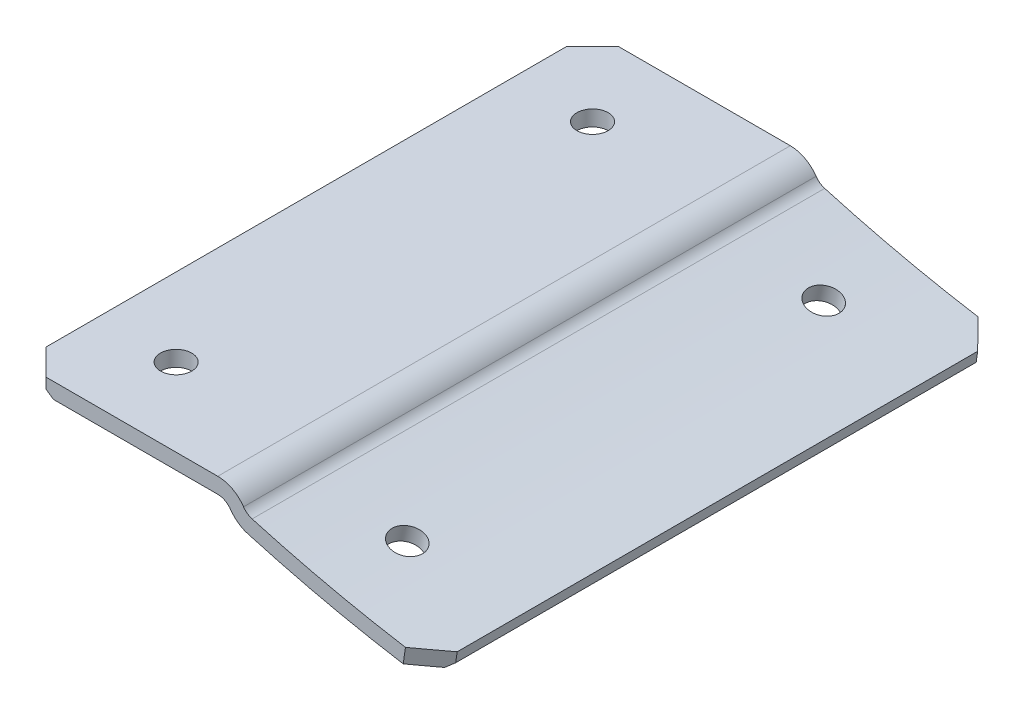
ISO-10303-21;
HEADER;
FILE_DESCRIPTION(('STEP AP214'),'2;1');
FILE_NAME('part.step','',(''),(''),'','','');
FILE_SCHEMA(('AUTOMOTIVE_DESIGN { 1 0 10303 214 1 1 1 1 }'));
ENDSEC;
DATA;
#1=APPLICATION_CONTEXT('core data for automotive mechanical design processes');
#2=APPLICATION_PROTOCOL_DEFINITION('international standard','automotive_design',2000,#1);
#3=PRODUCT_CONTEXT('',#1,'mechanical');
#4=PRODUCT('Part','Part','',(#3));
#5=PRODUCT_RELATED_PRODUCT_CATEGORY('part','',(#4));
#6=PRODUCT_DEFINITION_FORMATION('','',#4);
#7=PRODUCT_DEFINITION_CONTEXT('part definition',#1,'design');
#8=PRODUCT_DEFINITION('design','',#6,#7);
#9=PRODUCT_DEFINITION_SHAPE('','',#8);
#10=(LENGTH_UNIT() NAMED_UNIT(*) SI_UNIT(.MILLI.,.METRE.));
#11=(NAMED_UNIT(*) PLANE_ANGLE_UNIT() SI_UNIT($,.RADIAN.));
#12=(NAMED_UNIT(*) SI_UNIT($,.STERADIAN.) SOLID_ANGLE_UNIT());
#13=UNCERTAINTY_MEASURE_WITH_UNIT(LENGTH_MEASURE(1.E-05),#10,'distance_accuracy_value','');
#14=(GEOMETRIC_REPRESENTATION_CONTEXT(3) GLOBAL_UNCERTAINTY_ASSIGNED_CONTEXT((#13)) GLOBAL_UNIT_ASSIGNED_CONTEXT((#10,
#11,#12)) REPRESENTATION_CONTEXT('',''));
#15=CARTESIAN_POINT('',(0.,0.,0.));
#16=DIRECTION('',(0.,0.,1.));
#17=DIRECTION('',(1.,0.,0.));
#18=AXIS2_PLACEMENT_3D('',#15,#16,#17);
#19=CARTESIAN_POINT('',(101.733745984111,247.86768403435,55.));
#20=DIRECTION('',(0.,0.,-1.));
#21=DIRECTION('',(-1.,0.,0.));
#22=AXIS2_PLACEMENT_3D('',#19,#20,#21);
#23=CYLINDRICAL_SURFACE('',#22,264.801261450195);
#24=DIRECTION('',(0.,0.,-1.));
#25=VECTOR('',#24,1.);
#26=CARTESIAN_POINT('',(28.7734140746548,-6.68387858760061,55.));
#27=LINE('',#26,#25);
#28=CARTESIAN_POINT('',(28.7734140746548,-6.68387858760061,55.));
#29=VERTEX_POINT('',#28);
#30=CARTESIAN_POINT('',(28.7734140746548,-6.68387858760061,-55.));
#31=VERTEX_POINT('',#30);
#32=EDGE_CURVE('E468',#29,#31,#27,.T.);
#33=ORIENTED_EDGE('',*,*,#32,.T.);
#34=CARTESIAN_POINT('',(101.733745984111,247.86768403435,-55.));
#35=DIRECTION('',(0.,0.,1.));
#36=DIRECTION('',(1.,0.,0.));
#37=AXIS2_PLACEMENT_3D('',#34,#35,#36);
#38=CIRCLE('',#37,264.801261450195);
#39=CARTESIAN_POINT('',(58.6266176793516,-13.4013029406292,-55.));
#40=VERTEX_POINT('',#39);
#41=EDGE_CURVE('E197',#31,#40,#38,.T.);
#42=ORIENTED_EDGE('',*,*,#41,.T.);
#43=CARTESIAN_POINT('',(101.733745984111,247.86768403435,-49.9999999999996));
#44=DIRECTION('',(0.699723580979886,-0.10191619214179,-0.707106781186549));
#45=DIRECTION('',(0.69972358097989,-0.10191619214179,0.707106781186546));
#46=AXIS2_PLACEMENT_3D('',#43,#44,#45);
#47=ELLIPSE('',#46,374.485535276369,264.801261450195);
#48=CARTESIAN_POINT('',(62.5801802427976,-14.022954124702,-50.9981188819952));
#49=VERTEX_POINT('',#48);
#50=EDGE_CURVE('E489',#49,#40,#47,.T.);
#51=ORIENTED_EDGE('',*,*,#50,.F.);
#52=DIRECTION('',(0.,0.,-1.));
#53=VECTOR('',#52,1.);
#54=CARTESIAN_POINT('',(62.5801802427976,-14.0229541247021,55.));
#55=LINE('',#54,#53);
#56=CARTESIAN_POINT('',(62.5801802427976,-14.022954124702,50.9981188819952));
#57=VERTEX_POINT('',#56);
#58=EDGE_CURVE('E409',#49,#57,#55,.F.);
#59=ORIENTED_EDGE('',*,*,#58,.T.);
#60=CARTESIAN_POINT('',(101.733745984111,247.86768403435,49.9999999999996));
#61=DIRECTION('',(-0.699723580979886,0.10191619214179,-0.707106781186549));
#62=DIRECTION('',(0.69972358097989,-0.10191619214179,-0.707106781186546));
#63=AXIS2_PLACEMENT_3D('',#60,#61,#62);
#64=ELLIPSE('',#63,374.485535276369,264.801261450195);
#65=CARTESIAN_POINT('',(58.6266176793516,-13.4013029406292,55.));
#66=VERTEX_POINT('',#65);
#67=EDGE_CURVE('E381',#57,#66,#64,.T.);
#68=ORIENTED_EDGE('',*,*,#67,.T.);
#69=CARTESIAN_POINT('',(101.733745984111,247.86768403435,55.));
#70=DIRECTION('',(0.,0.,1.));
#71=DIRECTION('',(1.,0.,0.));
#72=AXIS2_PLACEMENT_3D('',#69,#70,#71);
#73=CIRCLE('',#72,264.801261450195);
#74=EDGE_CURVE('E477',#29,#66,#73,.T.);
#75=ORIENTED_EDGE('',*,*,#74,.F.);
#76=EDGE_LOOP('',(#33,#42,#51,#59,#68,#75));
#77=FACE_BOUND('',#76,.T.);
#78=CARTESIAN_POINT('',(46.6934717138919,-11.1502232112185,40.));
#79=CARTESIAN_POINT('',(46.6934643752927,-11.1502218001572,40.168508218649));
#80=CARTESIAN_POINT('',(46.6795368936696,-11.1472633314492,40.3371384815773));
#81=CARTESIAN_POINT('',(46.6241737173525,-11.1354894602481,40.6697545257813));
#82=CARTESIAN_POINT('',(46.5827049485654,-11.1266670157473,40.8337344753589));
#83=CARTESIAN_POINT('',(46.4734486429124,-11.1033774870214,41.1521830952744));
#84=CARTESIAN_POINT('',(46.4056737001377,-11.0889131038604,41.3066562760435));
#85=CARTESIAN_POINT('',(46.2457594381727,-11.0546944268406,41.6017326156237));
#86=CARTESIAN_POINT('',(46.1536261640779,-11.034941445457,41.7423392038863));
#87=CARTESIAN_POINT('',(45.9476055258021,-10.9906279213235,42.0057590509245));
#88=CARTESIAN_POINT('',(45.8337153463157,-10.9660667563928,42.1285700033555));
#89=CARTESIAN_POINT('',(45.5874338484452,-10.9127548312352,42.3528937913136));
#90=CARTESIAN_POINT('',(45.4550418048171,-10.8840039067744,42.4544057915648));
#91=CARTESIAN_POINT('',(45.1755369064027,-10.8230531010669,42.6332430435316));
#92=CARTESIAN_POINT('',(45.0284242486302,-10.7908532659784,42.7105686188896));
#93=CARTESIAN_POINT('',(44.7236674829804,-10.7238535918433,42.8388392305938));
#94=CARTESIAN_POINT('',(44.5660233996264,-10.6890537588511,42.8897843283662));
#95=CARTESIAN_POINT('',(44.2446960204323,-10.6177976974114,42.9638462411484));
#96=CARTESIAN_POINT('',(44.0810129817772,-10.5813415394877,42.9869642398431));
#97=CARTESIAN_POINT('',(43.7522532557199,-10.5077848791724,43.0047197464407));
#98=CARTESIAN_POINT('',(43.5871765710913,-10.4706843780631,42.9993573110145));
#99=CARTESIAN_POINT('',(43.2603181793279,-10.3968980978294,42.9603052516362));
#100=CARTESIAN_POINT('',(43.0985363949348,-10.3602123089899,42.9266162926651));
#101=CARTESIAN_POINT('',(42.7828486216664,-10.2883269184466,42.8318689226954));
#102=CARTESIAN_POINT('',(42.6289426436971,-10.2531273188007,42.7708104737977));
#103=CARTESIAN_POINT('',(42.3333554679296,-10.1852653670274,42.6230540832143));
#104=CARTESIAN_POINT('',(42.1916748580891,-10.1526031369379,42.5363549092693));
#105=CARTESIAN_POINT('',(41.9245519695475,-10.0908149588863,42.3397791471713));
#106=CARTESIAN_POINT('',(41.7991096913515,-10.0616890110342,42.229902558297));
#107=CARTESIAN_POINT('',(41.5679989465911,-10.0078771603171,41.9900829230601));
#108=CARTESIAN_POINT('',(41.462331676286,-9.98319152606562,41.8601386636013));
#109=CARTESIAN_POINT('',(41.2737625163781,-9.93904177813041,41.5838765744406));
#110=CARTESIAN_POINT('',(41.1908606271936,-9.91957766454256,41.4375587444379));
#111=CARTESIAN_POINT('',(41.0501622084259,-9.8864933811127,41.1327057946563));
#112=CARTESIAN_POINT('',(40.9923651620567,-9.87287309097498,40.9741709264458));
#113=CARTESIAN_POINT('',(40.9035038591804,-9.85191516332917,40.6493817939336));
#114=CARTESIAN_POINT('',(40.8724395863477,-9.84457752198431,40.4831275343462));
#115=CARTESIAN_POINT('',(40.8379211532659,-9.83642323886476,40.1476341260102));
#116=CARTESIAN_POINT('',(40.834464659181,-9.83560604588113,39.9783952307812));
#117=CARTESIAN_POINT('',(40.8552530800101,-9.84051776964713,39.6417234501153));
#118=CARTESIAN_POINT('',(40.8794979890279,-9.84624668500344,39.4742905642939));
#119=CARTESIAN_POINT('',(40.9550043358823,-9.86406433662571,39.1459898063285));
#120=CARTESIAN_POINT('',(41.0062648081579,-9.87615284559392,38.9851216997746));
#121=CARTESIAN_POINT('',(41.1343565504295,-9.90629907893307,38.6745098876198));
#122=CARTESIAN_POINT('',(41.2111878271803,-9.92435680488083,38.5247661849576));
#123=CARTESIAN_POINT('',(41.3882602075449,-9.9658643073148,38.2406437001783));
#124=CARTESIAN_POINT('',(41.4885027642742,-9.98931441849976,38.1062658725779));
#125=CARTESIAN_POINT('',(41.7095669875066,-10.0408634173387,37.8566991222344));
#126=CARTESIAN_POINT('',(41.8303886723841,-10.0689623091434,37.7415102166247));
#127=CARTESIAN_POINT('',(42.0892097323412,-10.1289341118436,37.5335824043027));
#128=CARTESIAN_POINT('',(42.2272103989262,-10.1608073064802,37.4408451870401));
#129=CARTESIAN_POINT('',(42.5164815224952,-10.2273481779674,37.2804645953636));
#130=CARTESIAN_POINT('',(42.6677519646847,-10.2620158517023,37.2128211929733));
#131=CARTESIAN_POINT('',(42.9792804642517,-10.3331028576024,37.1045493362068));
#132=CARTESIAN_POINT('',(43.1395384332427,-10.3695221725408,37.0639206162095));
#133=CARTESIAN_POINT('',(43.4645024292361,-10.44304176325,37.0108311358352));
#134=CARTESIAN_POINT('',(43.6292084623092,-10.4801420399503,36.9983704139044));
#135=CARTESIAN_POINT('',(43.958383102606,-10.5539558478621,37.0019712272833));
#136=CARTESIAN_POINT('',(44.1228517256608,-10.5906694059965,37.0180307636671));
#137=CARTESIAN_POINT('',(44.4468910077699,-10.6626853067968,37.0782126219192));
#138=CARTESIAN_POINT('',(44.6064616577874,-10.697987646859,37.1223349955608));
#139=CARTESIAN_POINT('',(44.9161644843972,-10.7662187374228,37.2373893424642));
#140=CARTESIAN_POINT('',(45.0662967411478,-10.799147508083,37.3083210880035));
#141=CARTESIAN_POINT('',(45.3528437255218,-10.8617566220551,37.4749776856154));
#142=CARTESIAN_POINT('',(45.4892589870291,-10.8914370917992,37.5707015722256));
#143=CARTESIAN_POINT('',(45.7444821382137,-10.9467813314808,37.7842182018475));
#144=CARTESIAN_POINT('',(45.8632911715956,-10.9724453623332,37.902009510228));
#145=CARTESIAN_POINT('',(46.0799511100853,-11.0191165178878,38.1563600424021));
#146=CARTESIAN_POINT('',(46.1777968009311,-11.0401224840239,38.2929239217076));
#147=CARTESIAN_POINT('',(46.3497395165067,-11.0769580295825,38.5809721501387));
#148=CARTESIAN_POINT('',(46.4238243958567,-11.0927849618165,38.7324640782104));
#149=CARTESIAN_POINT('',(46.5459919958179,-11.1188480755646,39.0458976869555));
#150=CARTESIAN_POINT('',(46.5941058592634,-11.1290909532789,39.2078265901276));
#151=CARTESIAN_POINT('',(46.6501433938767,-11.1410131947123,39.4756550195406));
#152=CARTESIAN_POINT('',(46.6663710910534,-11.1444631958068,39.5798146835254));
#153=CARTESIAN_POINT('',(46.6880375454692,-11.1490686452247,39.7893003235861));
#154=CARTESIAN_POINT('',(46.693476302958,-11.1502240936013,39.8946262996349));
#155=CARTESIAN_POINT('',(46.6934717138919,-11.1502232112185,40.));
#156=B_SPLINE_CURVE_WITH_KNOTS('',3,(#78,#79,#80,#81,#82,#83,#84,#85,#86,#87,#88,#89,#90,#91,
#92,#93,#94,#95,#96,#97,#98,#99,#100,#101,#102,#103,#104,#105,#106,#107,#108,#109,#110,#111,
#112,#113,#114,#115,#116,#117,#118,#119,#120,#121,#122,#123,#124,#125,#126,#127,#128,#129,#130,
#131,#132,#133,#134,#135,#136,#137,#138,#139,#140,#141,#142,#143,#144,#145,#146,#147,#148,#149,
#150,#151,#152,#153,#154,#155),.UNSPECIFIED.,.T.,.F.,(4,2,2,2,2,2,2,2,2,2,2,2,2,2,2,2,2,2,2,2,2,
2,2,2,2,2,2,2,2,2,2,2,2,2,2,2,2,2,4),(0.,0.505140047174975,1.01088781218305,1.5163937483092,
2.02177434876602,2.52722038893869,3.032686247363,3.53814534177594,4.04360325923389,
4.54903967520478,5.0544750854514,5.55989863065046,6.0653228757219,6.57077141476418,
7.07621996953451,7.58169909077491,8.08717822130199,8.59264694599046,9.09811536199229,
9.60354104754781,10.1089666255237,10.6143741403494,11.119781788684,11.6252208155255,
12.1306602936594,12.6361377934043,13.1416147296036,13.6470866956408,14.1525593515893,
14.6579965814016,15.1634347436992,15.6688686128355,16.1742828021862,16.6796641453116,
17.1851710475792,17.6909359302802,18.1960929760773,18.5119735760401,18.8278541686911),.UNSPECIFIED.);
#157=CARTESIAN_POINT('',(46.6934717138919,-11.1502232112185,40.));
#158=VERTEX_POINT('',#157);
#159=EDGE_CURVE('E301',#158,#158,#156,.T.);
#160=ORIENTED_EDGE('',*,*,#159,.F.);
#161=EDGE_LOOP('',(#160));
#162=FACE_BOUND('',#161,.T.);
#163=CARTESIAN_POINT('',(46.6934717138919,-11.1502232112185,-40.));
#164=CARTESIAN_POINT('',(46.6934643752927,-11.1502218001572,-40.168508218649));
#165=CARTESIAN_POINT('',(46.6795368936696,-11.1472633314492,-40.3371384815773));
#166=CARTESIAN_POINT('',(46.6241737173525,-11.1354894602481,-40.6697545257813));
#167=CARTESIAN_POINT('',(46.5827049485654,-11.1266670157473,-40.8337344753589));
#168=CARTESIAN_POINT('',(46.4734486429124,-11.1033774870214,-41.1521830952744));
#169=CARTESIAN_POINT('',(46.4056737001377,-11.0889131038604,-41.3066562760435));
#170=CARTESIAN_POINT('',(46.2457594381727,-11.0546944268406,-41.6017326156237));
#171=CARTESIAN_POINT('',(46.1536261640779,-11.034941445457,-41.7423392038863));
#172=CARTESIAN_POINT('',(45.9476055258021,-10.9906279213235,-42.0057590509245));
#173=CARTESIAN_POINT('',(45.8337153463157,-10.9660667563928,-42.1285700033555));
#174=CARTESIAN_POINT('',(45.5874338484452,-10.9127548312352,-42.3528937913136));
#175=CARTESIAN_POINT('',(45.4550418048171,-10.8840039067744,-42.4544057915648));
#176=CARTESIAN_POINT('',(45.1755369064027,-10.8230531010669,-42.6332430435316));
#177=CARTESIAN_POINT('',(45.0284242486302,-10.7908532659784,-42.7105686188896));
#178=CARTESIAN_POINT('',(44.7236674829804,-10.7238535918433,-42.8388392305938));
#179=CARTESIAN_POINT('',(44.5660233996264,-10.6890537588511,-42.8897843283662));
#180=CARTESIAN_POINT('',(44.2446960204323,-10.6177976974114,-42.9638462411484));
#181=CARTESIAN_POINT('',(44.0810129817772,-10.5813415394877,-42.9869642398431));
#182=CARTESIAN_POINT('',(43.7522532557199,-10.5077848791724,-43.0047197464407));
#183=CARTESIAN_POINT('',(43.5871765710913,-10.4706843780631,-42.9993573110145));
#184=CARTESIAN_POINT('',(43.2603181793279,-10.3968980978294,-42.9603052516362));
#185=CARTESIAN_POINT('',(43.0985363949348,-10.3602123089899,-42.9266162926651));
#186=CARTESIAN_POINT('',(42.7828486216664,-10.2883269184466,-42.8318689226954));
#187=CARTESIAN_POINT('',(42.6289426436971,-10.2531273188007,-42.7708104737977));
#188=CARTESIAN_POINT('',(42.3333554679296,-10.1852653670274,-42.6230540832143));
#189=CARTESIAN_POINT('',(42.1916748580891,-10.1526031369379,-42.5363549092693));
#190=CARTESIAN_POINT('',(41.9245519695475,-10.0908149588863,-42.3397791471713));
#191=CARTESIAN_POINT('',(41.7991096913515,-10.0616890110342,-42.229902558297));
#192=CARTESIAN_POINT('',(41.5679989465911,-10.0078771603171,-41.9900829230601));
#193=CARTESIAN_POINT('',(41.462331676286,-9.98319152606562,-41.8601386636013));
#194=CARTESIAN_POINT('',(41.2737625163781,-9.93904177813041,-41.5838765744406));
#195=CARTESIAN_POINT('',(41.1908606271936,-9.91957766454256,-41.4375587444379));
#196=CARTESIAN_POINT('',(41.0501622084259,-9.8864933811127,-41.1327057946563));
#197=CARTESIAN_POINT('',(40.9923651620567,-9.87287309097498,-40.9741709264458));
#198=CARTESIAN_POINT('',(40.9035038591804,-9.85191516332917,-40.6493817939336));
#199=CARTESIAN_POINT('',(40.8724395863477,-9.84457752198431,-40.4831275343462));
#200=CARTESIAN_POINT('',(40.8379211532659,-9.83642323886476,-40.1476341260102));
#201=CARTESIAN_POINT('',(40.834464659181,-9.83560604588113,-39.9783952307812));
#202=CARTESIAN_POINT('',(40.8552530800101,-9.84051776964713,-39.6417234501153));
#203=CARTESIAN_POINT('',(40.8794979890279,-9.84624668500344,-39.4742905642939));
#204=CARTESIAN_POINT('',(40.9550043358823,-9.86406433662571,-39.1459898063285));
#205=CARTESIAN_POINT('',(41.0062648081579,-9.87615284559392,-38.9851216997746));
#206=CARTESIAN_POINT('',(41.1343565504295,-9.90629907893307,-38.6745098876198));
#207=CARTESIAN_POINT('',(41.2111878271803,-9.92435680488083,-38.5247661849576));
#208=CARTESIAN_POINT('',(41.3882602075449,-9.9658643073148,-38.2406437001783));
#209=CARTESIAN_POINT('',(41.4885027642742,-9.98931441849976,-38.1062658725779));
#210=CARTESIAN_POINT('',(41.7095669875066,-10.0408634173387,-37.8566991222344));
#211=CARTESIAN_POINT('',(41.8303886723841,-10.0689623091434,-37.7415102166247));
#212=CARTESIAN_POINT('',(42.0892097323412,-10.1289341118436,-37.5335824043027));
#213=CARTESIAN_POINT('',(42.2272103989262,-10.1608073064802,-37.4408451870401));
#214=CARTESIAN_POINT('',(42.5164815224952,-10.2273481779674,-37.2804645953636));
#215=CARTESIAN_POINT('',(42.6677519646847,-10.2620158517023,-37.2128211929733));
#216=CARTESIAN_POINT('',(42.9792804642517,-10.3331028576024,-37.1045493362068));
#217=CARTESIAN_POINT('',(43.1395384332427,-10.3695221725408,-37.0639206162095));
#218=CARTESIAN_POINT('',(43.4645024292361,-10.44304176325,-37.0108311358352));
#219=CARTESIAN_POINT('',(43.6292084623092,-10.4801420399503,-36.9983704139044));
#220=CARTESIAN_POINT('',(43.958383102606,-10.5539558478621,-37.0019712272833));
#221=CARTESIAN_POINT('',(44.1228517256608,-10.5906694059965,-37.0180307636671));
#222=CARTESIAN_POINT('',(44.4468910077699,-10.6626853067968,-37.0782126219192));
#223=CARTESIAN_POINT('',(44.6064616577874,-10.697987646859,-37.1223349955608));
#224=CARTESIAN_POINT('',(44.9161644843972,-10.7662187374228,-37.2373893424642));
#225=CARTESIAN_POINT('',(45.0662967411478,-10.799147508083,-37.3083210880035));
#226=CARTESIAN_POINT('',(45.3528437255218,-10.8617566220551,-37.4749776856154));
#227=CARTESIAN_POINT('',(45.4892589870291,-10.8914370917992,-37.5707015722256));
#228=CARTESIAN_POINT('',(45.7444821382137,-10.9467813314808,-37.7842182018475));
#229=CARTESIAN_POINT('',(45.8632911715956,-10.9724453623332,-37.902009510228));
#230=CARTESIAN_POINT('',(46.0799511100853,-11.0191165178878,-38.1563600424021));
#231=CARTESIAN_POINT('',(46.1777968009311,-11.0401224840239,-38.2929239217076));
#232=CARTESIAN_POINT('',(46.3497395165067,-11.0769580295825,-38.5809721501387));
#233=CARTESIAN_POINT('',(46.4238243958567,-11.0927849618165,-38.7324640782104));
#234=CARTESIAN_POINT('',(46.5459919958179,-11.1188480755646,-39.0458976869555));
#235=CARTESIAN_POINT('',(46.5941058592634,-11.1290909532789,-39.2078265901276));
#236=CARTESIAN_POINT('',(46.6501433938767,-11.1410131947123,-39.4756550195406));
#237=CARTESIAN_POINT('',(46.6663710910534,-11.1444631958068,-39.5798146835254));
#238=CARTESIAN_POINT('',(46.6880375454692,-11.1490686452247,-39.7893003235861));
#239=CARTESIAN_POINT('',(46.693476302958,-11.1502240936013,-39.8946262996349));
#240=CARTESIAN_POINT('',(46.6934717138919,-11.1502232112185,-40.));
#241=B_SPLINE_CURVE_WITH_KNOTS('',3,(#163,#164,#165,#166,#167,#168,#169,#170,#171,#172,#173,
#174,#175,#176,#177,#178,#179,#180,#181,#182,#183,#184,#185,#186,#187,#188,#189,#190,#191,#192,
#193,#194,#195,#196,#197,#198,#199,#200,#201,#202,#203,#204,#205,#206,#207,#208,#209,#210,#211,
#212,#213,#214,#215,#216,#217,#218,#219,#220,#221,#222,#223,#224,#225,#226,#227,#228,#229,#230,
#231,#232,#233,#234,#235,#236,#237,#238,#239,#240),.UNSPECIFIED.,.T.,.F.,(4,2,2,2,2,2,2,2,2,2,2,
2,2,2,2,2,2,2,2,2,2,2,2,2,2,2,2,2,2,2,2,2,2,2,2,2,2,2,4),(0.,0.505140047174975,1.01088781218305,
1.5163937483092,2.02177434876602,2.52722038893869,3.032686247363,3.53814534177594,
4.04360325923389,4.54903967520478,5.0544750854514,5.55989863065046,6.0653228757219,
6.57077141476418,7.07621996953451,7.58169909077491,8.08717822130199,8.59264694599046,
9.09811536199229,9.60354104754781,10.1089666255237,10.6143741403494,11.119781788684,
11.6252208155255,12.1306602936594,12.6361377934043,13.1416147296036,13.6470866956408,
14.1525593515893,14.6579965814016,15.1634347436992,15.6688686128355,16.1742828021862,
16.6796641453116,17.1851710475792,17.6909359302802,18.1960929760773,18.5119735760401,
18.8278541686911),.UNSPECIFIED.);
#242=CARTESIAN_POINT('',(46.6934717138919,-11.1502232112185,-40.));
#243=VERTEX_POINT('',#242);
#244=EDGE_CURVE('E237',#243,#243,#241,.T.);
#245=ORIENTED_EDGE('',*,*,#244,.T.);
#246=EDGE_LOOP('',(#245));
#247=FACE_BOUND('',#246,.T.);
#248=ADVANCED_FACE('F46',(#77,#162,#247),#23,.T.);
#249=CARTESIAN_POINT('',(101.733745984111,247.86768403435,55.));
#250=DIRECTION('',(0.,0.,-1.));
#251=DIRECTION('',(-1.,0.,0.));
#252=AXIS2_PLACEMENT_3D('',#249,#250,#251);
#253=CYLINDRICAL_SURFACE('',#252,261.801261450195);
#254=CARTESIAN_POINT('',(101.733745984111,247.86768403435,55.));
#255=DIRECTION('',(0.,0.,1.));
#256=DIRECTION('',(1.,0.,0.));
#257=AXIS2_PLACEMENT_3D('',#254,#255,#256);
#258=CIRCLE('',#257,261.801261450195);
#259=CARTESIAN_POINT('',(29.6,-3.8,55.));
#260=VERTEX_POINT('',#259);
#261=CARTESIAN_POINT('',(59.0590894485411,-10.4320917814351,55.));
#262=VERTEX_POINT('',#261);
#263=EDGE_CURVE('E480',#260,#262,#258,.T.);
#264=ORIENTED_EDGE('',*,*,#263,.T.);
#265=CARTESIAN_POINT('',(101.733745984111,247.86768403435,49.9999999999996));
#266=DIRECTION('',(-0.699723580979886,0.10191619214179,-0.707106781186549));
#267=DIRECTION('',(0.69972358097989,-0.10191619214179,-0.707106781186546));
#268=AXIS2_PLACEMENT_3D('',#265,#266,#267);
#269=ELLIPSE('',#268,370.24289458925,261.801261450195);
#270=CARTESIAN_POINT('',(64.0000000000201,-11.2,50.));
#271=VERTEX_POINT('',#270);
#272=EDGE_CURVE('E398',#262,#271,#269,.F.);
#273=ORIENTED_EDGE('',*,*,#272,.T.);
#274=DIRECTION('',(0.,0.,-1.));
#275=VECTOR('',#274,1.);
#276=CARTESIAN_POINT('',(64.0000000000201,-11.2,55.));
#277=LINE('',#276,#275);
#278=CARTESIAN_POINT('',(64.0000000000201,-11.2,-50.));
#279=VERTEX_POINT('',#278);
#280=EDGE_CURVE('E178',#271,#279,#277,.T.);
#281=ORIENTED_EDGE('',*,*,#280,.T.);
#282=CARTESIAN_POINT('',(101.733745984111,247.86768403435,-49.9999999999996));
#283=DIRECTION('',(0.699723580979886,-0.10191619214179,-0.707106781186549));
#284=DIRECTION('',(0.69972358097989,-0.10191619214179,0.707106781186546));
#285=AXIS2_PLACEMENT_3D('',#282,#283,#284);
#286=ELLIPSE('',#285,370.24289458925,261.801261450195);
#287=CARTESIAN_POINT('',(59.0590894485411,-10.4320917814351,-55.));
#288=VERTEX_POINT('',#287);
#289=EDGE_CURVE('E195',#288,#279,#286,.F.);
#290=ORIENTED_EDGE('',*,*,#289,.F.);
#291=CARTESIAN_POINT('',(101.733745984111,247.86768403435,-55.));
#292=DIRECTION('',(0.,0.,1.));
#293=DIRECTION('',(1.,0.,0.));
#294=AXIS2_PLACEMENT_3D('',#291,#292,#293);
#295=CIRCLE('',#294,261.801261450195);
#296=CARTESIAN_POINT('',(29.6,-3.8,-55.));
#297=VERTEX_POINT('',#296);
#298=EDGE_CURVE('E185',#297,#288,#295,.T.);
#299=ORIENTED_EDGE('',*,*,#298,.F.);
#300=DIRECTION('',(0.,0.,-1.));
#301=VECTOR('',#300,1.);
#302=CARTESIAN_POINT('',(29.6,-3.8,55.));
#303=LINE('',#302,#301);
#304=EDGE_CURVE('E167',#260,#297,#303,.T.);
#305=ORIENTED_EDGE('',*,*,#304,.F.);
#306=EDGE_LOOP('',(#264,#273,#281,#290,#299,#305));
#307=FACE_BOUND('',#306,.T.);
#308=CARTESIAN_POINT('',(47.3428158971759,-8.22122088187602,40.));
#309=CARTESIAN_POINT('',(47.3428085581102,-8.22121947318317,40.1685081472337));
#310=CARTESIAN_POINT('',(47.3288807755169,-8.21826241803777,40.3371383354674));
#311=CARTESIAN_POINT('',(47.2735164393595,-8.20649401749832,40.6697542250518));
#312=CARTESIAN_POINT('',(47.2320468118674,-8.19767563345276,40.8337340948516));
#313=CARTESIAN_POINT('',(47.1227883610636,-8.17439630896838,41.1521825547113));
#314=CARTESIAN_POINT('',(47.0550121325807,-8.15993806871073,41.3066556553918));
#315=CARTESIAN_POINT('',(46.8950950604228,-8.12573290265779,41.6017318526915));
#316=CARTESIAN_POINT('',(46.802960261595,-8.1059872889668,41.742338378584));
#317=CARTESIAN_POINT('',(46.5969365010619,-8.06168865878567,42.0057582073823));
#318=CARTESIAN_POINT('',(46.4830447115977,-8.03713501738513,42.1285691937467));
#319=CARTESIAN_POINT('',(46.2367601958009,-7.98383717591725,42.3528930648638));
#320=CARTESIAN_POINT('',(46.1043667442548,-7.95509281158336,42.4544051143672));
#321=CARTESIAN_POINT('',(45.8248594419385,-7.89415309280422,42.6332424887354));
#322=CARTESIAN_POINT('',(45.6777457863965,-7.86195778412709,42.7105681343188));
#323=CARTESIAN_POINT('',(45.3729876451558,-7.7949642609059,42.8388388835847));
#324=CARTESIAN_POINT('',(45.2153431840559,-7.76016605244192,42.8897840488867));
#325=CARTESIAN_POINT('',(44.8940159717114,-7.68890980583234,42.9638460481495));
#326=CARTESIAN_POINT('',(44.730333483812,-7.65245184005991,42.9869640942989));
#327=CARTESIAN_POINT('',(44.4015756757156,-7.57888790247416,43.0047197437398));
#328=CARTESIAN_POINT('',(44.2365003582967,-7.54178193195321,42.9993574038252));
#329=CARTESIAN_POINT('',(43.9096455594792,-7.46798128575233,42.9603056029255));
#330=CARTESIAN_POINT('',(43.7478659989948,-7.43128660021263,42.9266168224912));
#331=CARTESIAN_POINT('',(43.4321832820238,-7.35938057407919,42.8318699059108));
#332=CARTESIAN_POINT('',(43.2782801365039,-7.32416923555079,42.7708117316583));
#333=CARTESIAN_POINT('',(42.9826988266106,-7.25628186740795,42.623055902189));
#334=CARTESIAN_POINT('',(42.841021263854,-7.22360596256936,42.536356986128));
#335=CARTESIAN_POINT('',(42.5739045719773,-7.16178972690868,42.3397817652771));
#336=CARTESIAN_POINT('',(42.4484654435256,-7.13264939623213,42.229905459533));
#337=CARTESIAN_POINT('',(42.2173606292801,-7.07880933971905,41.9900862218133));
#338=CARTESIAN_POINT('',(42.1116961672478,-7.05410988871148,41.8601420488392));
#339=CARTESIAN_POINT('',(41.9231321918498,-7.00993441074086,41.5838800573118));
#340=CARTESIAN_POINT('',(41.8402326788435,-6.99045838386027,41.4375622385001));
#341=CARTESIAN_POINT('',(41.6995383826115,-6.95735332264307,41.1327092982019));
#342=CARTESIAN_POINT('',(41.6417430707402,-6.94372416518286,40.9741744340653));
#343=CARTESIAN_POINT('',(41.5528843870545,-6.92275239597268,40.6493852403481));
#344=CARTESIAN_POINT('',(41.5218209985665,-6.91540978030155,40.4831309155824));
#345=CARTESIAN_POINT('',(41.4873034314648,-6.90724993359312,40.1476376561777));
#346=CARTESIAN_POINT('',(41.4838468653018,-6.90643213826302,39.978398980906));
#347=CARTESIAN_POINT('',(41.504634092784,-6.91134706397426,39.641727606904));
#348=CARTESIAN_POINT('',(41.5288778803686,-6.91707978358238,39.4742949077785));
#349=CARTESIAN_POINT('',(41.6043809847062,-6.93490906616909,39.1459946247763));
#350=CARTESIAN_POINT('',(41.6556393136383,-6.94700539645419,38.9851268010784));
#351=CARTESIAN_POINT('',(41.7837259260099,-6.9771705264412,38.6745154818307));
#352=CARTESIAN_POINT('',(41.8605542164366,-6.99523932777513,38.5247719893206));
#353=CARTESIAN_POINT('',(42.0376201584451,-7.03677119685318,38.2406496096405));
#354=CARTESIAN_POINT('',(42.1378592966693,-7.06023460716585,38.1062716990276));
#355=CARTESIAN_POINT('',(42.3589164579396,-7.1118111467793,37.8567046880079));
#356=CARTESIAN_POINT('',(42.4797344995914,-7.13992428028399,37.7415156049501));
#357=CARTESIAN_POINT('',(42.7385485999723,-7.19992425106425,37.5335871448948));
#358=CARTESIAN_POINT('',(42.8765459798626,-7.23181137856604,37.4408494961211));
#359=CARTESIAN_POINT('',(43.1658109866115,-7.29837852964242,37.2804680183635));
#360=CARTESIAN_POINT('',(43.3170785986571,-7.33305855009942,37.2128241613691));
#361=CARTESIAN_POINT('',(43.6286020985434,-7.40416763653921,37.1045514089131));
#362=CARTESIAN_POINT('',(43.7888578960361,-7.44059668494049,37.0639222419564));
#363=CARTESIAN_POINT('',(44.1138183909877,-7.51413243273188,37.0108318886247));
#364=CARTESIAN_POINT('',(44.2785230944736,-7.55123913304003,36.998370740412));
#365=CARTESIAN_POINT('',(44.6076957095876,-7.62506209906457,37.00197074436));
#366=CARTESIAN_POINT('',(44.7721636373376,-7.66177839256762,37.0180298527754));
#367=CARTESIAN_POINT('',(45.0962023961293,-7.73379622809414,37.0782108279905));
#368=CARTESIAN_POINT('',(45.2557732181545,-7.7690977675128,37.1223327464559));
#369=CARTESIAN_POINT('',(45.5654770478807,-7.83732418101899,37.2373861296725));
#370=CARTESIAN_POINT('',(45.7156101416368,-7.87024907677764,37.3083173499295));
#371=CARTESIAN_POINT('',(46.0021594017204,-7.93284819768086,37.4749728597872));
#372=CARTESIAN_POINT('',(46.1385761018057,-7.96252254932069,37.5706961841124));
#373=CARTESIAN_POINT('',(46.3938026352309,-8.01785336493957,37.7842117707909));
#374=CARTESIAN_POINT('',(46.5126135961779,-8.0435100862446,37.902002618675));
#375=CARTESIAN_POINT('',(46.7292775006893,-8.09016652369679,38.156352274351));
#376=CARTESIAN_POINT('',(46.8271252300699,-8.11116508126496,38.2929157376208));
#377=CARTESIAN_POINT('',(46.9990719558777,-8.14798680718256,38.5809633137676));
#378=CARTESIAN_POINT('',(47.0731587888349,-8.16380732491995,38.7324550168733));
#379=CARTESIAN_POINT('',(47.1953299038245,-8.18985951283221,39.0458882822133));
#380=CARTESIAN_POINT('',(47.2434453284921,-8.20009787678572,39.2078170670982));
#381=CARTESIAN_POINT('',(47.2994852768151,-8.21201490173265,39.4756469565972));
#382=CARTESIAN_POINT('',(47.3157138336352,-8.21546339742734,39.5798081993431));
#383=CARTESIAN_POINT('',(47.3373814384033,-8.22006682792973,39.7892970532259));
#384=CARTESIAN_POINT('',(47.3428204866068,-8.22122176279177,39.8946246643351));
#385=CARTESIAN_POINT('',(47.3428158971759,-8.22122088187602,40.));
#386=B_SPLINE_CURVE_WITH_KNOTS('',3,(#308,#309,#310,#311,#312,#313,#314,#315,#316,#317,#318,
#319,#320,#321,#322,#323,#324,#325,#326,#327,#328,#329,#330,#331,#332,#333,#334,#335,#336,#337,
#338,#339,#340,#341,#342,#343,#344,#345,#346,#347,#348,#349,#350,#351,#352,#353,#354,#355,#356,
#357,#358,#359,#360,#361,#362,#363,#364,#365,#366,#367,#368,#369,#370,#371,#372,#373,#374,#375,
#376,#377,#378,#379,#380,#381,#382,#383,#384,#385),.UNSPECIFIED.,.T.,.F.,(4,2,2,2,2,2,2,2,2,2,2,
2,2,2,2,2,2,2,2,2,2,2,2,2,2,2,2,2,2,2,2,2,2,2,2,2,2,2,4),(0.,0.505139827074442,1.01088735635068,
1.51639304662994,2.02177340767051,2.52721949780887,3.03268540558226,3.53814461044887,
4.04360263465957,4.5490386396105,5.05447363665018,5.55989649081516,6.06532004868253,
6.57076846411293,7.07621690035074,7.58169660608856,8.08717631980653,8.59264538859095,
9.09811414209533,9.60353918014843,10.1089641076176,10.6143705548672,11.1197771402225,
11.6252158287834,12.1306549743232,12.6361330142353,13.1416104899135,13.6470828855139,
14.1525559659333,14.6579928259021,15.1634306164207,15.6688637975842,16.1742773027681,
16.6796584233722,17.1851651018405,17.6909301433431,18.1960873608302,18.5119728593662,
18.827858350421),.UNSPECIFIED.);
#387=CARTESIAN_POINT('',(47.3428158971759,-8.22122088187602,40.));
#388=VERTEX_POINT('',#387);
#389=EDGE_CURVE('E311',#388,#388,#386,.T.);
#390=ORIENTED_EDGE('',*,*,#389,.T.);
#391=EDGE_LOOP('',(#390));
#392=FACE_BOUND('',#391,.T.);
#393=CARTESIAN_POINT('',(47.3428158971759,-8.22122088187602,-40.));
#394=CARTESIAN_POINT('',(47.3428085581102,-8.22121947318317,-40.1685081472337));
#395=CARTESIAN_POINT('',(47.3288807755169,-8.21826241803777,-40.3371383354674));
#396=CARTESIAN_POINT('',(47.2735164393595,-8.20649401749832,-40.6697542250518));
#397=CARTESIAN_POINT('',(47.2320468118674,-8.19767563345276,-40.8337340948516));
#398=CARTESIAN_POINT('',(47.1227883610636,-8.17439630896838,-41.1521825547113));
#399=CARTESIAN_POINT('',(47.0550121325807,-8.15993806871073,-41.3066556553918));
#400=CARTESIAN_POINT('',(46.8950950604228,-8.12573290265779,-41.6017318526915));
#401=CARTESIAN_POINT('',(46.802960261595,-8.1059872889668,-41.742338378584));
#402=CARTESIAN_POINT('',(46.5969365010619,-8.06168865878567,-42.0057582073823));
#403=CARTESIAN_POINT('',(46.4830447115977,-8.03713501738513,-42.1285691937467));
#404=CARTESIAN_POINT('',(46.2367601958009,-7.98383717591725,-42.3528930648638));
#405=CARTESIAN_POINT('',(46.1043667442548,-7.95509281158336,-42.4544051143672));
#406=CARTESIAN_POINT('',(45.8248594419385,-7.89415309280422,-42.6332424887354));
#407=CARTESIAN_POINT('',(45.6777457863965,-7.86195778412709,-42.7105681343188));
#408=CARTESIAN_POINT('',(45.3729876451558,-7.7949642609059,-42.8388388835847));
#409=CARTESIAN_POINT('',(45.2153431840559,-7.76016605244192,-42.8897840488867));
#410=CARTESIAN_POINT('',(44.8940159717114,-7.68890980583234,-42.9638460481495));
#411=CARTESIAN_POINT('',(44.730333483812,-7.65245184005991,-42.9869640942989));
#412=CARTESIAN_POINT('',(44.4015756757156,-7.57888790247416,-43.0047197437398));
#413=CARTESIAN_POINT('',(44.2365003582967,-7.54178193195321,-42.9993574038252));
#414=CARTESIAN_POINT('',(43.9096455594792,-7.46798128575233,-42.9603056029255));
#415=CARTESIAN_POINT('',(43.7478659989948,-7.43128660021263,-42.9266168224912));
#416=CARTESIAN_POINT('',(43.4321832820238,-7.35938057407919,-42.8318699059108));
#417=CARTESIAN_POINT('',(43.2782801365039,-7.32416923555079,-42.7708117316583));
#418=CARTESIAN_POINT('',(42.9826988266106,-7.25628186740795,-42.623055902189));
#419=CARTESIAN_POINT('',(42.841021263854,-7.22360596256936,-42.536356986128));
#420=CARTESIAN_POINT('',(42.5739045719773,-7.16178972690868,-42.3397817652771));
#421=CARTESIAN_POINT('',(42.4484654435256,-7.13264939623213,-42.229905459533));
#422=CARTESIAN_POINT('',(42.2173606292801,-7.07880933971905,-41.9900862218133));
#423=CARTESIAN_POINT('',(42.1116961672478,-7.05410988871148,-41.8601420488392));
#424=CARTESIAN_POINT('',(41.9231321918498,-7.00993441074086,-41.5838800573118));
#425=CARTESIAN_POINT('',(41.8402326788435,-6.99045838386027,-41.4375622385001));
#426=CARTESIAN_POINT('',(41.6995383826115,-6.95735332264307,-41.1327092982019));
#427=CARTESIAN_POINT('',(41.6417430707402,-6.94372416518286,-40.9741744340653));
#428=CARTESIAN_POINT('',(41.5528843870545,-6.92275239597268,-40.6493852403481));
#429=CARTESIAN_POINT('',(41.5218209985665,-6.91540978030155,-40.4831309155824));
#430=CARTESIAN_POINT('',(41.4873034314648,-6.90724993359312,-40.1476376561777));
#431=CARTESIAN_POINT('',(41.4838468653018,-6.90643213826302,-39.978398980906));
#432=CARTESIAN_POINT('',(41.504634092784,-6.91134706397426,-39.641727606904));
#433=CARTESIAN_POINT('',(41.5288778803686,-6.91707978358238,-39.4742949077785));
#434=CARTESIAN_POINT('',(41.6043809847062,-6.93490906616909,-39.1459946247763));
#435=CARTESIAN_POINT('',(41.6556393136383,-6.94700539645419,-38.9851268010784));
#436=CARTESIAN_POINT('',(41.7837259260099,-6.9771705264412,-38.6745154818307));
#437=CARTESIAN_POINT('',(41.8605542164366,-6.99523932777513,-38.5247719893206));
#438=CARTESIAN_POINT('',(42.0376201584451,-7.03677119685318,-38.2406496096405));
#439=CARTESIAN_POINT('',(42.1378592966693,-7.06023460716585,-38.1062716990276));
#440=CARTESIAN_POINT('',(42.3589164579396,-7.1118111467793,-37.8567046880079));
#441=CARTESIAN_POINT('',(42.4797344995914,-7.13992428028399,-37.7415156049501));
#442=CARTESIAN_POINT('',(42.7385485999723,-7.19992425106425,-37.5335871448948));
#443=CARTESIAN_POINT('',(42.8765459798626,-7.23181137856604,-37.4408494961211));
#444=CARTESIAN_POINT('',(43.1658109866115,-7.29837852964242,-37.2804680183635));
#445=CARTESIAN_POINT('',(43.3170785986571,-7.33305855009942,-37.2128241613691));
#446=CARTESIAN_POINT('',(43.6286020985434,-7.40416763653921,-37.1045514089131));
#447=CARTESIAN_POINT('',(43.7888578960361,-7.44059668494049,-37.0639222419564));
#448=CARTESIAN_POINT('',(44.1138183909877,-7.51413243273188,-37.0108318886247));
#449=CARTESIAN_POINT('',(44.2785230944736,-7.55123913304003,-36.998370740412));
#450=CARTESIAN_POINT('',(44.6076957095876,-7.62506209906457,-37.00197074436));
#451=CARTESIAN_POINT('',(44.7721636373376,-7.66177839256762,-37.0180298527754));
#452=CARTESIAN_POINT('',(45.0962023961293,-7.73379622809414,-37.0782108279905));
#453=CARTESIAN_POINT('',(45.2557732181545,-7.7690977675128,-37.1223327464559));
#454=CARTESIAN_POINT('',(45.5654770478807,-7.83732418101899,-37.2373861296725));
#455=CARTESIAN_POINT('',(45.7156101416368,-7.87024907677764,-37.3083173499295));
#456=CARTESIAN_POINT('',(46.0021594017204,-7.93284819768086,-37.4749728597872));
#457=CARTESIAN_POINT('',(46.1385761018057,-7.96252254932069,-37.5706961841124));
#458=CARTESIAN_POINT('',(46.3938026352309,-8.01785336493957,-37.7842117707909));
#459=CARTESIAN_POINT('',(46.5126135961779,-8.0435100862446,-37.902002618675));
#460=CARTESIAN_POINT('',(46.7292775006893,-8.09016652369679,-38.156352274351));
#461=CARTESIAN_POINT('',(46.8271252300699,-8.11116508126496,-38.2929157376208));
#462=CARTESIAN_POINT('',(46.9990719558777,-8.14798680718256,-38.5809633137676));
#463=CARTESIAN_POINT('',(47.0731587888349,-8.16380732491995,-38.7324550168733));
#464=CARTESIAN_POINT('',(47.1953299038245,-8.18985951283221,-39.0458882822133));
#465=CARTESIAN_POINT('',(47.2434453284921,-8.20009787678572,-39.2078170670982));
#466=CARTESIAN_POINT('',(47.2994852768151,-8.21201490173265,-39.4756469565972));
#467=CARTESIAN_POINT('',(47.3157138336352,-8.21546339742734,-39.5798081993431));
#468=CARTESIAN_POINT('',(47.3373814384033,-8.22006682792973,-39.7892970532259));
#469=CARTESIAN_POINT('',(47.3428204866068,-8.22122176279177,-39.8946246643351));
#470=CARTESIAN_POINT('',(47.3428158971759,-8.22122088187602,-40.));
#471=B_SPLINE_CURVE_WITH_KNOTS('',3,(#393,#394,#395,#396,#397,#398,#399,#400,#401,#402,#403,
#404,#405,#406,#407,#408,#409,#410,#411,#412,#413,#414,#415,#416,#417,#418,#419,#420,#421,#422,
#423,#424,#425,#426,#427,#428,#429,#430,#431,#432,#433,#434,#435,#436,#437,#438,#439,#440,#441,
#442,#443,#444,#445,#446,#447,#448,#449,#450,#451,#452,#453,#454,#455,#456,#457,#458,#459,#460,
#461,#462,#463,#464,#465,#466,#467,#468,#469,#470),.UNSPECIFIED.,.T.,.F.,(4,2,2,2,2,2,2,2,2,2,2,
2,2,2,2,2,2,2,2,2,2,2,2,2,2,2,2,2,2,2,2,2,2,2,2,2,2,2,4),(0.,0.505139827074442,1.01088735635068,
1.51639304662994,2.02177340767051,2.52721949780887,3.03268540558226,3.53814461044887,
4.04360263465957,4.5490386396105,5.05447363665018,5.55989649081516,6.06532004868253,
6.57076846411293,7.07621690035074,7.58169660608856,8.08717631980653,8.59264538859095,
9.09811414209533,9.60353918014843,10.1089641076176,10.6143705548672,11.1197771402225,
11.6252158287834,12.1306549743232,12.6361330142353,13.1416104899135,13.6470828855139,
14.1525559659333,14.6579928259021,15.1634306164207,15.6688637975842,16.1742773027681,
16.6796584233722,17.1851651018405,17.6909301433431,18.1960873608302,18.5119728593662,
18.827858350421),.UNSPECIFIED.);
#472=CARTESIAN_POINT('',(47.3428158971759,-8.22122088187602,-40.));
#473=VERTEX_POINT('',#472);
#474=EDGE_CURVE('E228',#473,#473,#471,.T.);
#475=ORIENTED_EDGE('',*,*,#474,.F.);
#476=EDGE_LOOP('',(#475));
#477=FACE_BOUND('',#476,.T.);
#478=ADVANCED_FACE('F192',(#307,#392,#477),#253,.F.);
#479=CARTESIAN_POINT('',(64.0000000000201,-11.2,55.));
#480=DIRECTION('',(0.989558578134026,-0.144131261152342,0.));
#481=DIRECTION('',(0.144131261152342,0.989558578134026,0.));
#482=AXIS2_PLACEMENT_3D('',#479,#480,#481);
#483=PLANE('',#482);
#484=DIRECTION('',(-0.144131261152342,-0.989558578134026,0.));
#485=VECTOR('',#484,1.);
#486=CARTESIAN_POINT('',(64.0000000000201,-11.2,50.));
#487=LINE('',#486,#485);
#488=CARTESIAN_POINT('',(63.7117374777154,-13.1791171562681,50.));
#489=VERTEX_POINT('',#488);
#490=EDGE_CURVE('E335',#271,#489,#487,.T.);
#491=ORIENTED_EDGE('',*,*,#490,.T.);
#492=DIRECTION('',(0.,0.,-1.));
#493=VECTOR('',#492,1.);
#494=CARTESIAN_POINT('',(63.7117374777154,-13.1791171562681,0.));
#495=LINE('',#494,#493);
#496=CARTESIAN_POINT('',(63.7117374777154,-13.1791171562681,-50.));
#497=VERTEX_POINT('',#496);
#498=EDGE_CURVE('E406',#489,#497,#495,.T.);
#499=ORIENTED_EDGE('',*,*,#498,.T.);
#500=DIRECTION('',(-0.144131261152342,-0.989558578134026,0.));
#501=VECTOR('',#500,1.);
#502=CARTESIAN_POINT('',(64.0000000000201,-11.2,-50.));
#503=LINE('',#502,#501);
#504=EDGE_CURVE('E223',#279,#497,#503,.T.);
#505=ORIENTED_EDGE('',*,*,#504,.F.);
#506=ORIENTED_EDGE('',*,*,#280,.F.);
#507=EDGE_LOOP('',(#491,#499,#505,#506));
#508=FACE_BOUND('',#507,.T.);
#509=ADVANCED_FACE('F291',(#508),#483,.T.);
#510=CARTESIAN_POINT('',(30.4265859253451,-0.91612141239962,55.));
#511=DIRECTION('',(0.,0.,-1.));
#512=DIRECTION('',(-1.,0.,0.));
#513=AXIS2_PLACEMENT_3D('',#510,#511,#512);
#514=CYLINDRICAL_SURFACE('',#513,2.99999999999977);
#515=ORIENTED_EDGE('',*,*,#304,.T.);
#516=CARTESIAN_POINT('',(30.4265859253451,-0.91612141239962,-55.));
#517=DIRECTION('',(0.,0.,1.));
#518=DIRECTION('',(-1.,0.,0.));
#519=AXIS2_PLACEMENT_3D('',#516,#517,#518);
#520=CIRCLE('',#519,2.99999999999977);
#521=CARTESIAN_POINT('',(27.9510572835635,-2.61074760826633,-55.));
#522=VERTEX_POINT('',#521);
#523=EDGE_CURVE('E170',#522,#297,#520,.T.);
#524=ORIENTED_EDGE('',*,*,#523,.F.);
#525=DIRECTION('',(0.,0.,-1.));
#526=VECTOR('',#525,1.);
#527=CARTESIAN_POINT('',(27.9510572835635,-2.61074760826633,55.));
#528=LINE('',#527,#526);
#529=CARTESIAN_POINT('',(27.9510572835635,-2.61074760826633,55.));
#530=VERTEX_POINT('',#529);
#531=EDGE_CURVE('E179',#530,#522,#528,.T.);
#532=ORIENTED_EDGE('',*,*,#531,.F.);
#533=CARTESIAN_POINT('',(30.4265859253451,-0.91612141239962,55.));
#534=DIRECTION('',(0.,0.,1.));
#535=DIRECTION('',(-1.,0.,0.));
#536=AXIS2_PLACEMENT_3D('',#533,#534,#535);
#537=CIRCLE('',#536,2.99999999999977);
#538=EDGE_CURVE('E172',#530,#260,#537,.T.);
#539=ORIENTED_EDGE('',*,*,#538,.T.);
#540=EDGE_LOOP('',(#515,#524,#532,#539));
#541=FACE_BOUND('',#540,.T.);
#542=ADVANCED_FACE('F169',(#541),#514,.F.);
#543=CARTESIAN_POINT('',(23.,-6.,55.));
#544=DIRECTION('',(0.,0.,-1.));
#545=DIRECTION('',(-1.,0.,0.));
#546=AXIS2_PLACEMENT_3D('',#543,#544,#545);
#547=CYLINDRICAL_SURFACE('',#546,6.);
#548=ORIENTED_EDGE('',*,*,#531,.T.);
#549=CARTESIAN_POINT('',(23.,-6.,-55.));
#550=DIRECTION('',(0.,0.,-1.));
#551=DIRECTION('',(-1.,0.,0.));
#552=AXIS2_PLACEMENT_3D('',#549,#550,#551);
#553=CIRCLE('',#552,6.);
#554=CARTESIAN_POINT('',(23.,0.,-55.));
#555=VERTEX_POINT('',#554);
#556=EDGE_CURVE('E188',#555,#522,#553,.T.);
#557=ORIENTED_EDGE('',*,*,#556,.F.);
#558=DIRECTION('',(0.,0.,-1.));
#559=VECTOR('',#558,1.);
#560=CARTESIAN_POINT('',(23.,0.,55.));
#561=LINE('',#560,#559);
#562=CARTESIAN_POINT('',(23.,0.,55.));
#563=VERTEX_POINT('',#562);
#564=EDGE_CURVE('E363',#563,#555,#561,.T.);
#565=ORIENTED_EDGE('',*,*,#564,.F.);
#566=CARTESIAN_POINT('',(23.,-6.,55.));
#567=DIRECTION('',(0.,0.,-1.));
#568=DIRECTION('',(-1.,0.,0.));
#569=AXIS2_PLACEMENT_3D('',#566,#567,#568);
#570=CIRCLE('',#569,6.);
#571=EDGE_CURVE('E778',#563,#530,#570,.T.);
#572=ORIENTED_EDGE('',*,*,#571,.T.);
#573=EDGE_LOOP('',(#548,#557,#565,#572));
#574=FACE_BOUND('',#573,.T.);
#575=ADVANCED_FACE('F341',(#574),#547,.T.);
#576=CARTESIAN_POINT('',(-15.,0.,55.));
#577=DIRECTION('',(0.,1.,0.));
#578=DIRECTION('',(0.,0.,1.));
#579=AXIS2_PLACEMENT_3D('',#576,#577,#578);
#580=PLANE('',#579);
#581=CARTESIAN_POINT('',(0.,0.,40.));
#582=DIRECTION('',(0.,1.,0.));
#583=DIRECTION('',(-1.,0.,0.));
#584=AXIS2_PLACEMENT_3D('',#581,#582,#583);
#585=CIRCLE('',#584,3.);
#586=CARTESIAN_POINT('',(-3.,0.,40.));
#587=VERTEX_POINT('',#586);
#588=EDGE_CURVE('E310',#587,#587,#585,.T.);
#589=ORIENTED_EDGE('',*,*,#588,.F.);
#590=EDGE_LOOP('',(#589));
#591=FACE_BOUND('',#590,.T.);
#592=DIRECTION('',(0.,0.,-1.));
#593=VECTOR('',#592,1.);
#594=CARTESIAN_POINT('',(-15.,0.,55.));
#595=LINE('',#594,#593);
#596=CARTESIAN_POINT('',(-15.,0.,50.));
#597=VERTEX_POINT('',#596);
#598=CARTESIAN_POINT('',(-15.,0.,-50.));
#599=VERTEX_POINT('',#598);
#600=EDGE_CURVE('E354',#597,#599,#595,.T.);
#601=ORIENTED_EDGE('',*,*,#600,.F.);
#602=DIRECTION('',(-0.707106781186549,0.,-0.707106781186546));
#603=VECTOR('',#602,1.);
#604=CARTESIAN_POINT('',(-12.5,0.,52.5));
#605=LINE('',#604,#603);
#606=CARTESIAN_POINT('',(-9.99999999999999,0.,55.));
#607=VERTEX_POINT('',#606);
#608=EDGE_CURVE('E356',#597,#607,#605,.F.);
#609=ORIENTED_EDGE('',*,*,#608,.T.);
#610=DIRECTION('',(1.,0.,0.));
#611=VECTOR('',#610,1.);
#612=CARTESIAN_POINT('',(-15.,0.,55.));
#613=LINE('',#612,#611);
#614=EDGE_CURVE('E437',#607,#563,#613,.T.);
#615=ORIENTED_EDGE('',*,*,#614,.T.);
#616=ORIENTED_EDGE('',*,*,#564,.T.);
#617=DIRECTION('',(1.,0.,0.));
#618=VECTOR('',#617,1.);
#619=CARTESIAN_POINT('',(-15.,0.,-55.));
#620=LINE('',#619,#618);
#621=CARTESIAN_POINT('',(-9.99999999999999,0.,-55.));
#622=VERTEX_POINT('',#621);
#623=EDGE_CURVE('E208',#622,#555,#620,.T.);
#624=ORIENTED_EDGE('',*,*,#623,.F.);
#625=DIRECTION('',(-0.707106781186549,0.,0.707106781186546));
#626=VECTOR('',#625,1.);
#627=CARTESIAN_POINT('',(-12.5,0.,-52.5));
#628=LINE('',#627,#626);
#629=EDGE_CURVE('E360',#599,#622,#628,.F.);
#630=ORIENTED_EDGE('',*,*,#629,.F.);
#631=EDGE_LOOP('',(#601,#609,#615,#616,#624,#630));
#632=FACE_BOUND('',#631,.T.);
#633=CARTESIAN_POINT('',(0.,0.,-40.));
#634=DIRECTION('',(0.,-1.,0.));
#635=DIRECTION('',(-1.,0.,0.));
#636=AXIS2_PLACEMENT_3D('',#633,#634,#635);
#637=CIRCLE('',#636,3.);
#638=CARTESIAN_POINT('',(-3.,0.,-40.));
#639=VERTEX_POINT('',#638);
#640=EDGE_CURVE('E227',#639,#639,#637,.T.);
#641=ORIENTED_EDGE('',*,*,#640,.T.);
#642=EDGE_LOOP('',(#641));
#643=FACE_BOUND('',#642,.T.);
#644=ADVANCED_FACE('F262',(#591,#632,#643),#580,.T.);
#645=CARTESIAN_POINT('',(-15.,-3.,55.));
#646=DIRECTION('',(-1.,0.,0.));
#647=DIRECTION('',(0.,0.,1.));
#648=AXIS2_PLACEMENT_3D('',#645,#646,#647);
#649=PLANE('',#648);
#650=ORIENTED_EDGE('',*,*,#600,.T.);
#651=DIRECTION('',(0.,1.,0.));
#652=VECTOR('',#651,1.);
#653=CARTESIAN_POINT('',(-15.,-3.,-50.));
#654=LINE('',#653,#652);
#655=CARTESIAN_POINT('',(-15.,-1.99999999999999,-50.));
#656=VERTEX_POINT('',#655);
#657=EDGE_CURVE('E493',#656,#599,#654,.T.);
#658=ORIENTED_EDGE('',*,*,#657,.F.);
#659=DIRECTION('',(0.,0.,1.));
#660=VECTOR('',#659,1.);
#661=CARTESIAN_POINT('',(-15.,-1.99999999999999,50.));
#662=LINE('',#661,#660);
#663=CARTESIAN_POINT('',(-15.,-1.99999999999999,50.));
#664=VERTEX_POINT('',#663);
#665=EDGE_CURVE('E11',#656,#664,#662,.T.);
#666=ORIENTED_EDGE('',*,*,#665,.T.);
#667=DIRECTION('',(0.,1.,0.));
#668=VECTOR('',#667,1.);
#669=CARTESIAN_POINT('',(-15.,-3.,50.));
#670=LINE('',#669,#668);
#671=EDGE_CURVE('E401',#664,#597,#670,.T.);
#672=ORIENTED_EDGE('',*,*,#671,.T.);
#673=EDGE_LOOP('',(#650,#658,#666,#672));
#674=FACE_BOUND('',#673,.T.);
#675=ADVANCED_FACE('F272',(#674),#649,.T.);
#676=CARTESIAN_POINT('',(-15.,-3.,55.));
#677=DIRECTION('',(0.,1.,0.));
#678=DIRECTION('',(0.,0.,1.));
#679=AXIS2_PLACEMENT_3D('',#676,#677,#678);
#680=PLANE('',#679);
#681=CARTESIAN_POINT('',(0.,-3.,40.));
#682=DIRECTION('',(0.,1.,0.));
#683=DIRECTION('',(0.,0.,1.));
#684=AXIS2_PLACEMENT_3D('',#681,#682,#683);
#685=CIRCLE('',#684,3.);
#686=CARTESIAN_POINT('',(0.,-3.,43.));
#687=VERTEX_POINT('',#686);
#688=EDGE_CURVE('E333',#687,#687,#685,.T.);
#689=ORIENTED_EDGE('',*,*,#688,.T.);
#690=EDGE_LOOP('',(#689));
#691=FACE_BOUND('',#690,.T.);
#692=DIRECTION('',(1.,0.,0.));
#693=VECTOR('',#692,1.);
#694=CARTESIAN_POINT('',(-15.,-3.,55.));
#695=LINE('',#694,#693);
#696=CARTESIAN_POINT('',(-8.58578643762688,-3.,55.));
#697=VERTEX_POINT('',#696);
#698=CARTESIAN_POINT('',(23.,-3.,55.));
#699=VERTEX_POINT('',#698);
#700=EDGE_CURVE('E430',#697,#699,#695,.T.);
#701=ORIENTED_EDGE('',*,*,#700,.F.);
#702=DIRECTION('',(-0.707106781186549,0.,-0.707106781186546));
#703=VECTOR('',#702,1.);
#704=CARTESIAN_POINT('',(-14.2928932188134,-3.,49.2928932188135));
#705=LINE('',#704,#703);
#706=CARTESIAN_POINT('',(-14.,-3.,49.5857864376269));
#707=VERTEX_POINT('',#706);
#708=EDGE_CURVE('E418',#697,#707,#705,.T.);
#709=ORIENTED_EDGE('',*,*,#708,.T.);
#710=DIRECTION('',(0.,0.,-1.));
#711=VECTOR('',#710,1.);
#712=CARTESIAN_POINT('',(-14.,-3.,0.));
#713=LINE('',#712,#711);
#714=CARTESIAN_POINT('',(-14.,-3.,-49.5857864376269));
#715=VERTEX_POINT('',#714);
#716=EDGE_CURVE('E415',#707,#715,#713,.T.);
#717=ORIENTED_EDGE('',*,*,#716,.T.);
#718=DIRECTION('',(-0.707106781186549,0.,0.707106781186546));
#719=VECTOR('',#718,1.);
#720=CARTESIAN_POINT('',(-14.2928932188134,-3.,-49.2928932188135));
#721=LINE('',#720,#719);
#722=CARTESIAN_POINT('',(-8.58578643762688,-3.,-55.));
#723=VERTEX_POINT('',#722);
#724=EDGE_CURVE('E449',#723,#715,#721,.T.);
#725=ORIENTED_EDGE('',*,*,#724,.F.);
#726=DIRECTION('',(1.,0.,0.));
#727=VECTOR('',#726,1.);
#728=CARTESIAN_POINT('',(-15.,-3.,-55.));
#729=LINE('',#728,#727);
#730=CARTESIAN_POINT('',(23.,-3.,-55.));
#731=VERTEX_POINT('',#730);
#732=EDGE_CURVE('E211',#723,#731,#729,.T.);
#733=ORIENTED_EDGE('',*,*,#732,.T.);
#734=DIRECTION('',(0.,0.,-1.));
#735=VECTOR('',#734,1.);
#736=CARTESIAN_POINT('',(23.,-3.,55.));
#737=LINE('',#736,#735);
#738=EDGE_CURVE('E364',#699,#731,#737,.T.);
#739=ORIENTED_EDGE('',*,*,#738,.F.);
#740=EDGE_LOOP('',(#701,#709,#717,#725,#733,#739));
#741=FACE_BOUND('',#740,.T.);
#742=CARTESIAN_POINT('',(0.,-3.,-40.));
#743=DIRECTION('',(0.,-1.,0.));
#744=DIRECTION('',(0.,0.,-1.));
#745=AXIS2_PLACEMENT_3D('',#742,#743,#744);
#746=CIRCLE('',#745,3.);
#747=CARTESIAN_POINT('',(0.,-3.,-43.));
#748=VERTEX_POINT('',#747);
#749=EDGE_CURVE('E202',#748,#748,#746,.T.);
#750=ORIENTED_EDGE('',*,*,#749,.F.);
#751=EDGE_LOOP('',(#750));
#752=FACE_BOUND('',#751,.T.);
#753=ADVANCED_FACE('F269',(#691,#741,#752),#680,.F.);
#754=CARTESIAN_POINT('',(23.,-6.,55.));
#755=DIRECTION('',(0.,0.,-1.));
#756=DIRECTION('',(-1.,0.,0.));
#757=AXIS2_PLACEMENT_3D('',#754,#755,#756);
#758=CYLINDRICAL_SURFACE('',#757,3.);
#759=ORIENTED_EDGE('',*,*,#738,.T.);
#760=CARTESIAN_POINT('',(23.,-6.,-55.));
#761=DIRECTION('',(0.,0.,1.));
#762=DIRECTION('',(1.,0.,0.));
#763=AXIS2_PLACEMENT_3D('',#760,#761,#762);
#764=CIRCLE('',#763,3.);
#765=CARTESIAN_POINT('',(25.4755286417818,-4.30537380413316,-55.));
#766=VERTEX_POINT('',#765);
#767=EDGE_CURVE('E215',#731,#766,#764,.F.);
#768=ORIENTED_EDGE('',*,*,#767,.T.);
#769=DIRECTION('',(0.,0.,-1.));
#770=VECTOR('',#769,1.);
#771=CARTESIAN_POINT('',(25.4755286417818,-4.30537380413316,55.));
#772=LINE('',#771,#770);
#773=CARTESIAN_POINT('',(25.4755286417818,-4.30537380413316,55.));
#774=VERTEX_POINT('',#773);
#775=EDGE_CURVE('E370',#774,#766,#772,.T.);
#776=ORIENTED_EDGE('',*,*,#775,.F.);
#777=CARTESIAN_POINT('',(23.,-6.,55.));
#778=DIRECTION('',(0.,0.,1.));
#779=DIRECTION('',(1.,0.,0.));
#780=AXIS2_PLACEMENT_3D('',#777,#778,#779);
#781=CIRCLE('',#780,3.);
#782=EDGE_CURVE('E436',#699,#774,#781,.F.);
#783=ORIENTED_EDGE('',*,*,#782,.F.);
#784=EDGE_LOOP('',(#759,#768,#776,#783));
#785=FACE_BOUND('',#784,.T.);
#786=ADVANCED_FACE('F271',(#785),#758,.F.);
#787=CARTESIAN_POINT('',(30.4265859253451,-0.91612141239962,55.));
#788=DIRECTION('',(0.,0.,-1.));
#789=DIRECTION('',(-1.,0.,0.));
#790=AXIS2_PLACEMENT_3D('',#787,#788,#789);
#791=CYLINDRICAL_SURFACE('',#790,5.99999999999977);
#792=ORIENTED_EDGE('',*,*,#775,.T.);
#793=CARTESIAN_POINT('',(30.4265859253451,-0.91612141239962,-55.));
#794=DIRECTION('',(0.,0.,1.));
#795=DIRECTION('',(1.,0.,0.));
#796=AXIS2_PLACEMENT_3D('',#793,#794,#795);
#797=CIRCLE('',#796,5.99999999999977);
#798=EDGE_CURVE('E219',#766,#31,#797,.T.);
#799=ORIENTED_EDGE('',*,*,#798,.T.);
#800=ORIENTED_EDGE('',*,*,#32,.F.);
#801=CARTESIAN_POINT('',(30.4265859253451,-0.91612141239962,55.));
#802=DIRECTION('',(0.,0.,1.));
#803=DIRECTION('',(1.,0.,0.));
#804=AXIS2_PLACEMENT_3D('',#801,#802,#803);
#805=CIRCLE('',#804,5.99999999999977);
#806=EDGE_CURVE('E464',#774,#29,#805,.T.);
#807=ORIENTED_EDGE('',*,*,#806,.F.);
#808=EDGE_LOOP('',(#792,#799,#800,#807));
#809=FACE_BOUND('',#808,.T.);
#810=ADVANCED_FACE('F279',(#809),#791,.T.);
#811=CARTESIAN_POINT('',(101.733745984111,247.86768403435,55.));
#812=DIRECTION('',(0.,0.,1.));
#813=DIRECTION('',(1.,0.,0.));
#814=AXIS2_PLACEMENT_3D('',#811,#812,#813);
#815=PLANE('',#814);
#816=DIRECTION('',(0.,-1.,0.));
#817=VECTOR('',#816,1.);
#818=CARTESIAN_POINT('',(-9.99999999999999,247.86768403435,55.));
#819=LINE('',#818,#817);
#820=CARTESIAN_POINT('',(-9.99999999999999,-1.99999999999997,55.));
#821=VERTEX_POINT('',#820);
#822=EDGE_CURVE('E387',#607,#821,#819,.T.);
#823=ORIENTED_EDGE('',*,*,#822,.T.);
#824=DIRECTION('',(-0.816496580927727,0.577350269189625,0.));
#825=VECTOR('',#824,1.);
#826=CARTESIAN_POINT('',(-53.2995918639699,28.6174350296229,55.));
#827=LINE('',#826,#825);
#828=EDGE_CURVE('E57',#821,#697,#827,.F.);
#829=ORIENTED_EDGE('',*,*,#828,.T.);
#830=ORIENTED_EDGE('',*,*,#700,.T.);
#831=ORIENTED_EDGE('',*,*,#782,.T.);
#832=ORIENTED_EDGE('',*,*,#806,.T.);
#833=ORIENTED_EDGE('',*,*,#74,.T.);
#834=DIRECTION('',(0.144131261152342,0.989558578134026,0.));
#835=VECTOR('',#834,1.);
#836=CARTESIAN_POINT('',(96.7859530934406,248.588340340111,55.));
#837=LINE('',#836,#835);
#838=EDGE_CURVE('E393',#66,#262,#837,.T.);
#839=ORIENTED_EDGE('',*,*,#838,.T.);
#840=ORIENTED_EDGE('',*,*,#263,.F.);
#841=ORIENTED_EDGE('',*,*,#538,.F.);
#842=ORIENTED_EDGE('',*,*,#571,.F.);
#843=ORIENTED_EDGE('',*,*,#614,.F.);
#844=EDGE_LOOP('',(#823,#829,#830,#831,#832,#833,#839,#840,#841,#842,#843));
#845=FACE_BOUND('',#844,.T.);
#846=ADVANCED_FACE('F429',(#845),#815,.T.);
#847=CARTESIAN_POINT('',(0.,-14.1686757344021,40.));
#848=DIRECTION('',(0.,1.,0.));
#849=DIRECTION('',(-1.,0.,0.));
#850=AXIS2_PLACEMENT_3D('',#847,#848,#849);
#851=CYLINDRICAL_SURFACE('',#850,3.);
#852=ORIENTED_EDGE('',*,*,#588,.T.);
#853=EDGE_LOOP('',(#852));
#854=FACE_BOUND('',#853,.T.);
#855=ORIENTED_EDGE('',*,*,#688,.F.);
#856=EDGE_LOOP('',(#855));
#857=FACE_BOUND('',#856,.T.);
#858=ADVANCED_FACE('F319',(#854,#857),#851,.F.);
#859=CARTESIAN_POINT('',(46.9314711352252,3.78400174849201,40.));
#860=DIRECTION('',(-0.216439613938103,-0.976296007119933,0.));
#861=DIRECTION('',(0.976296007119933,-0.216439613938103,0.));
#862=AXIS2_PLACEMENT_3D('',#859,#860,#861);
#863=CYLINDRICAL_SURFACE('',#862,3.);
#864=ORIENTED_EDGE('',*,*,#389,.F.);
#865=EDGE_LOOP('',(#864));
#866=FACE_BOUND('',#865,.T.);
#867=ORIENTED_EDGE('',*,*,#159,.T.);
#868=EDGE_LOOP('',(#867));
#869=FACE_BOUND('',#868,.T.);
#870=ADVANCED_FACE('F314',(#866,#869),#863,.F.);
#871=CARTESIAN_POINT('',(64.0000000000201,-11.2,50.));
#872=DIRECTION('',(-0.699723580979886,0.10191619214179,-0.707106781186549));
#873=DIRECTION('',(-0.144131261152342,-0.989558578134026,0.));
#874=AXIS2_PLACEMENT_3D('',#871,#872,#873);
#875=PLANE('',#874);
#876=ORIENTED_EDGE('',*,*,#67,.F.);
#877=DIRECTION('',(0.654536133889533,0.488107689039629,-0.577350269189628));
#878=VECTOR('',#877,1.);
#879=CARTESIAN_POINT('',(64.4675307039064,-12.615498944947,49.3333333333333));
#880=LINE('',#879,#878);
#881=EDGE_CURVE('E412',#57,#489,#880,.T.);
#882=ORIENTED_EDGE('',*,*,#881,.T.);
#883=ORIENTED_EDGE('',*,*,#490,.F.);
#884=ORIENTED_EDGE('',*,*,#272,.F.);
#885=ORIENTED_EDGE('',*,*,#838,.F.);
#886=EDGE_LOOP('',(#876,#882,#883,#884,#885));
#887=FACE_BOUND('',#886,.T.);
#888=ADVANCED_FACE('F298',(#887),#875,.F.);
#889=CARTESIAN_POINT('',(-15.,-3.,50.));
#890=DIRECTION('',(0.707106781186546,0.,-0.707106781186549));
#891=DIRECTION('',(0.,1.,0.));
#892=AXIS2_PLACEMENT_3D('',#889,#890,#891);
#893=PLANE('',#892);
#894=ORIENTED_EDGE('',*,*,#671,.F.);
#895=DIRECTION('',(-0.707106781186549,0.,-0.707106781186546));
#896=VECTOR('',#895,1.);
#897=CARTESIAN_POINT('',(-9.99999999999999,-1.99999999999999,55.));
#898=LINE('',#897,#896);
#899=EDGE_CURVE('E69',#664,#821,#898,.F.);
#900=ORIENTED_EDGE('',*,*,#899,.T.);
#901=ORIENTED_EDGE('',*,*,#822,.F.);
#902=ORIENTED_EDGE('',*,*,#608,.F.);
#903=EDGE_LOOP('',(#894,#900,#901,#902));
#904=FACE_BOUND('',#903,.T.);
#905=ADVANCED_FACE('F521',(#904),#893,.F.);
#906=CARTESIAN_POINT('',(63.7117374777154,-13.1791171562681,55.));
#907=DIRECTION('',(-0.597807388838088,0.801639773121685,0.));
#908=DIRECTION('',(0.,0.,-1.));
#909=AXIS2_PLACEMENT_3D('',#906,#907,#908);
#910=PLANE('',#909);
#911=ORIENTED_EDGE('',*,*,#881,.F.);
#912=ORIENTED_EDGE('',*,*,#58,.F.);
#913=DIRECTION('',(0.654536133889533,0.488107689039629,0.577350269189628));
#914=VECTOR('',#913,1.);
#915=CARTESIAN_POINT('',(64.4675307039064,-12.615498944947,-49.3333333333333));
#916=LINE('',#915,#914);
#917=EDGE_CURVE('E454',#49,#497,#916,.T.);
#918=ORIENTED_EDGE('',*,*,#917,.T.);
#919=ORIENTED_EDGE('',*,*,#498,.F.);
#920=EDGE_LOOP('',(#911,#912,#918,#919));
#921=FACE_BOUND('',#920,.T.);
#922=ADVANCED_FACE('F519',(#921),#910,.F.);
#923=CARTESIAN_POINT('',(-14.,-3.,55.));
#924=DIRECTION('',(-0.707106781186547,-0.707106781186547,0.));
#925=DIRECTION('',(0.,0.,1.));
#926=AXIS2_PLACEMENT_3D('',#923,#924,#925);
#927=PLANE('',#926);
#928=ORIENTED_EDGE('',*,*,#665,.F.);
#929=DIRECTION('',(0.678598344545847,-0.678598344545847,0.28108463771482));
#930=VECTOR('',#929,1.);
#931=CARTESIAN_POINT('',(-15.032726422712,-1.967273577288,-50.0135557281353));
#932=LINE('',#931,#930);
#933=EDGE_CURVE('E238',#656,#715,#932,.T.);
#934=ORIENTED_EDGE('',*,*,#933,.T.);
#935=ORIENTED_EDGE('',*,*,#716,.F.);
#936=DIRECTION('',(0.678598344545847,-0.678598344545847,-0.28108463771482));
#937=VECTOR('',#936,1.);
#938=CARTESIAN_POINT('',(-15.032726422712,-1.967273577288,50.0135557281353));
#939=LINE('',#938,#937);
#940=EDGE_CURVE('E51',#664,#707,#939,.T.);
#941=ORIENTED_EDGE('',*,*,#940,.F.);
#942=EDGE_LOOP('',(#928,#934,#935,#941));
#943=FACE_BOUND('',#942,.T.);
#944=ADVANCED_FACE('F49',(#943),#927,.T.);
#945=CARTESIAN_POINT('',(-11.7928932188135,-3.,51.7928932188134));
#946=DIRECTION('',(0.499999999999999,0.707106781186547,-0.500000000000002));
#947=DIRECTION('',(-0.707106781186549,0.,-0.707106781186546));
#948=AXIS2_PLACEMENT_3D('',#945,#946,#947);
#949=PLANE('',#948);
#950=ORIENTED_EDGE('',*,*,#828,.F.);
#951=ORIENTED_EDGE('',*,*,#899,.F.);
#952=ORIENTED_EDGE('',*,*,#940,.T.);
#953=ORIENTED_EDGE('',*,*,#708,.F.);
#954=EDGE_LOOP('',(#950,#951,#952,#953));
#955=FACE_BOUND('',#954,.T.);
#956=ADVANCED_FACE('F439',(#955),#949,.F.);
#957=CARTESIAN_POINT('',(101.733745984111,247.86768403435,-55.));
#958=DIRECTION('',(0.,0.,-1.));
#959=DIRECTION('',(1.,0.,0.));
#960=AXIS2_PLACEMENT_3D('',#957,#958,#959);
#961=PLANE('',#960);
#962=DIRECTION('',(0.,-1.,0.));
#963=VECTOR('',#962,1.);
#964=CARTESIAN_POINT('',(-9.99999999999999,247.86768403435,-55.));
#965=LINE('',#964,#963);
#966=CARTESIAN_POINT('',(-9.99999999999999,-1.99999999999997,-55.));
#967=VERTEX_POINT('',#966);
#968=EDGE_CURVE('E499',#622,#967,#965,.T.);
#969=ORIENTED_EDGE('',*,*,#968,.F.);
#970=ORIENTED_EDGE('',*,*,#623,.T.);
#971=ORIENTED_EDGE('',*,*,#556,.T.);
#972=ORIENTED_EDGE('',*,*,#523,.T.);
#973=ORIENTED_EDGE('',*,*,#298,.T.);
#974=DIRECTION('',(0.144131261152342,0.989558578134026,0.));
#975=VECTOR('',#974,1.);
#976=CARTESIAN_POINT('',(96.7859530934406,248.588340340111,-55.));
#977=LINE('',#976,#975);
#978=EDGE_CURVE('E491',#40,#288,#977,.T.);
#979=ORIENTED_EDGE('',*,*,#978,.F.);
#980=ORIENTED_EDGE('',*,*,#41,.F.);
#981=ORIENTED_EDGE('',*,*,#798,.F.);
#982=ORIENTED_EDGE('',*,*,#767,.F.);
#983=ORIENTED_EDGE('',*,*,#732,.F.);
#984=DIRECTION('',(-0.816496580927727,0.577350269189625,0.));
#985=VECTOR('',#984,1.);
#986=CARTESIAN_POINT('',(-53.2995918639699,28.6174350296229,-55.));
#987=LINE('',#986,#985);
#988=EDGE_CURVE('E444',#967,#723,#987,.F.);
#989=ORIENTED_EDGE('',*,*,#988,.F.);
#990=EDGE_LOOP('',(#969,#970,#971,#972,#973,#979,#980,#981,#982,#983,#989));
#991=FACE_BOUND('',#990,.T.);
#992=ADVANCED_FACE('F184',(#991),#961,.T.);
#993=CARTESIAN_POINT('',(0.,-14.1686757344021,-40.));
#994=DIRECTION('',(0.,1.,0.));
#995=DIRECTION('',(-1.,0.,0.));
#996=AXIS2_PLACEMENT_3D('',#993,#994,#995);
#997=CYLINDRICAL_SURFACE('',#996,3.);
#998=ORIENTED_EDGE('',*,*,#640,.F.);
#999=EDGE_LOOP('',(#998));
#1000=FACE_BOUND('',#999,.T.);
#1001=ORIENTED_EDGE('',*,*,#749,.T.);
#1002=EDGE_LOOP('',(#1001));
#1003=FACE_BOUND('',#1002,.T.);
#1004=ADVANCED_FACE('F264',(#1000,#1003),#997,.F.);
#1005=CARTESIAN_POINT('',(46.9314711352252,3.78400174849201,-40.));
#1006=DIRECTION('',(-0.216439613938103,-0.976296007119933,0.));
#1007=DIRECTION('',(0.976296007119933,-0.216439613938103,0.));
#1008=AXIS2_PLACEMENT_3D('',#1005,#1006,#1007);
#1009=CYLINDRICAL_SURFACE('',#1008,3.);
#1010=ORIENTED_EDGE('',*,*,#474,.T.);
#1011=EDGE_LOOP('',(#1010));
#1012=FACE_BOUND('',#1011,.T.);
#1013=ORIENTED_EDGE('',*,*,#244,.F.);
#1014=EDGE_LOOP('',(#1013));
#1015=FACE_BOUND('',#1014,.T.);
#1016=ADVANCED_FACE('F240',(#1012,#1015),#1009,.F.);
#1017=CARTESIAN_POINT('',(64.0000000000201,-11.2,-50.));
#1018=DIRECTION('',(-0.699723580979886,0.10191619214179,0.707106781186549));
#1019=DIRECTION('',(-0.144131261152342,-0.989558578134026,0.));
#1020=AXIS2_PLACEMENT_3D('',#1017,#1018,#1019);
#1021=PLANE('',#1020);
#1022=ORIENTED_EDGE('',*,*,#50,.T.);
#1023=ORIENTED_EDGE('',*,*,#978,.T.);
#1024=ORIENTED_EDGE('',*,*,#289,.T.);
#1025=ORIENTED_EDGE('',*,*,#504,.T.);
#1026=ORIENTED_EDGE('',*,*,#917,.F.);
#1027=EDGE_LOOP('',(#1022,#1023,#1024,#1025,#1026));
#1028=FACE_BOUND('',#1027,.T.);
#1029=ADVANCED_FACE('F249',(#1028),#1021,.F.);
#1030=CARTESIAN_POINT('',(-15.,-3.,-50.));
#1031=DIRECTION('',(0.707106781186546,0.,0.707106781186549));
#1032=DIRECTION('',(0.,1.,0.));
#1033=AXIS2_PLACEMENT_3D('',#1030,#1031,#1032);
#1034=PLANE('',#1033);
#1035=ORIENTED_EDGE('',*,*,#657,.T.);
#1036=ORIENTED_EDGE('',*,*,#629,.T.);
#1037=ORIENTED_EDGE('',*,*,#968,.T.);
#1038=DIRECTION('',(-0.707106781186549,0.,0.707106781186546));
#1039=VECTOR('',#1038,1.);
#1040=CARTESIAN_POINT('',(-9.99999999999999,-1.99999999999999,-55.));
#1041=LINE('',#1040,#1039);
#1042=EDGE_CURVE('E453',#656,#967,#1041,.F.);
#1043=ORIENTED_EDGE('',*,*,#1042,.F.);
#1044=EDGE_LOOP('',(#1035,#1036,#1037,#1043));
#1045=FACE_BOUND('',#1044,.T.);
#1046=ADVANCED_FACE('F512',(#1045),#1034,.F.);
#1047=CARTESIAN_POINT('',(-11.7928932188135,-3.,-51.7928932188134));
#1048=DIRECTION('',(0.499999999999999,0.707106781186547,0.500000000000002));
#1049=DIRECTION('',(-0.707106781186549,0.,0.707106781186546));
#1050=AXIS2_PLACEMENT_3D('',#1047,#1048,#1049);
#1051=PLANE('',#1050);
#1052=ORIENTED_EDGE('',*,*,#988,.T.);
#1053=ORIENTED_EDGE('',*,*,#724,.T.);
#1054=ORIENTED_EDGE('',*,*,#933,.F.);
#1055=ORIENTED_EDGE('',*,*,#1042,.T.);
#1056=EDGE_LOOP('',(#1052,#1053,#1054,#1055));
#1057=FACE_BOUND('',#1056,.T.);
#1058=ADVANCED_FACE('F322',(#1057),#1051,.F.);
#1059=CLOSED_SHELL('',(#248,#478,#509,#542,#575,#644,#675,#753,#786,#810,#846,#858,#870,#888,
#905,#922,#944,#956,#992,#1004,#1016,#1029,#1046,#1058));
#1060=MANIFOLD_SOLID_BREP('B2',#1059);
#1061=ADVANCED_BREP_SHAPE_REPRESENTATION('',(#18,#1060),#14);
#1062=SHAPE_DEFINITION_REPRESENTATION(#9,#1061);
ENDSEC;
END-ISO-10303-21;
